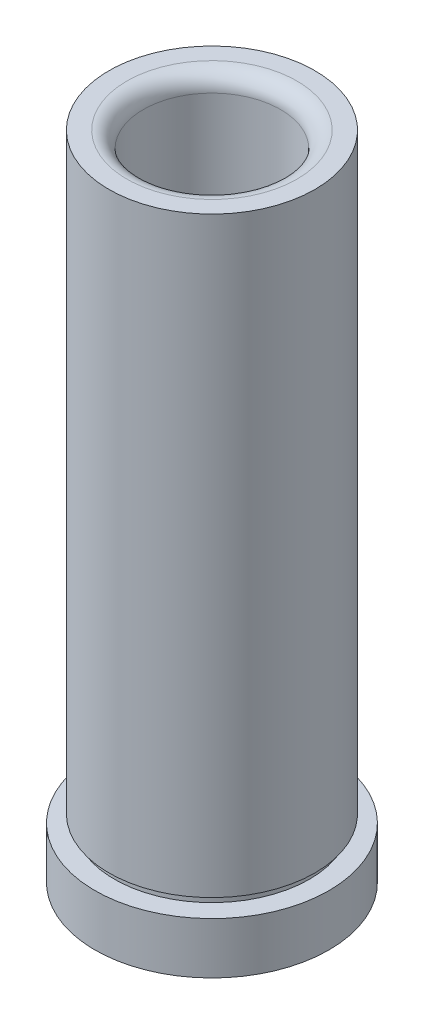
from build123d import *

# Parameters (mm, degrees)
FILLET1_R     = 1.524
CHAMFER1_SIZE = 1.524


with BuildPart() as part:
    # Sketch1 → Revolve1 (revolve)
    with BuildSketch(Plane.XY, mode=Mode.PRIVATE) as revolve1_sk:
        Polygon((-6.35, 60.325), (-6.35, 34.925), (-7.112, 34.163), (-7.112, 0), (-10.8331, 0), (-10.8331, 4.7625), (-9.02335, 4.7625), (-9.02335, 5.5245), (-9.53135, 5.5245), (-9.53135, 60.325), align=None)
    revolve(revolve1_sk.sketch.rotate(Axis((0, -1000, 0), (0, 1, 0)), 180), axis=Axis((0, -1000, 0), (0, 1, 0)))

    # Fillet1
    fillet1_edges = [part.edges().sort_by_distance(p)[0] for p in [
        (-6.35, 60.325, 0),
    ]]
    fillet(fillet1_edges, radius=FILLET1_R)

    # Chamfer1
    chamfer1_edges = [part.edges().sort_by_distance(p)[0] for p in [
        (-7.112, 0, 0),
    ]]
    chamfer(chamfer1_edges, length=CHAMFER1_SIZE)


solid = part.part
